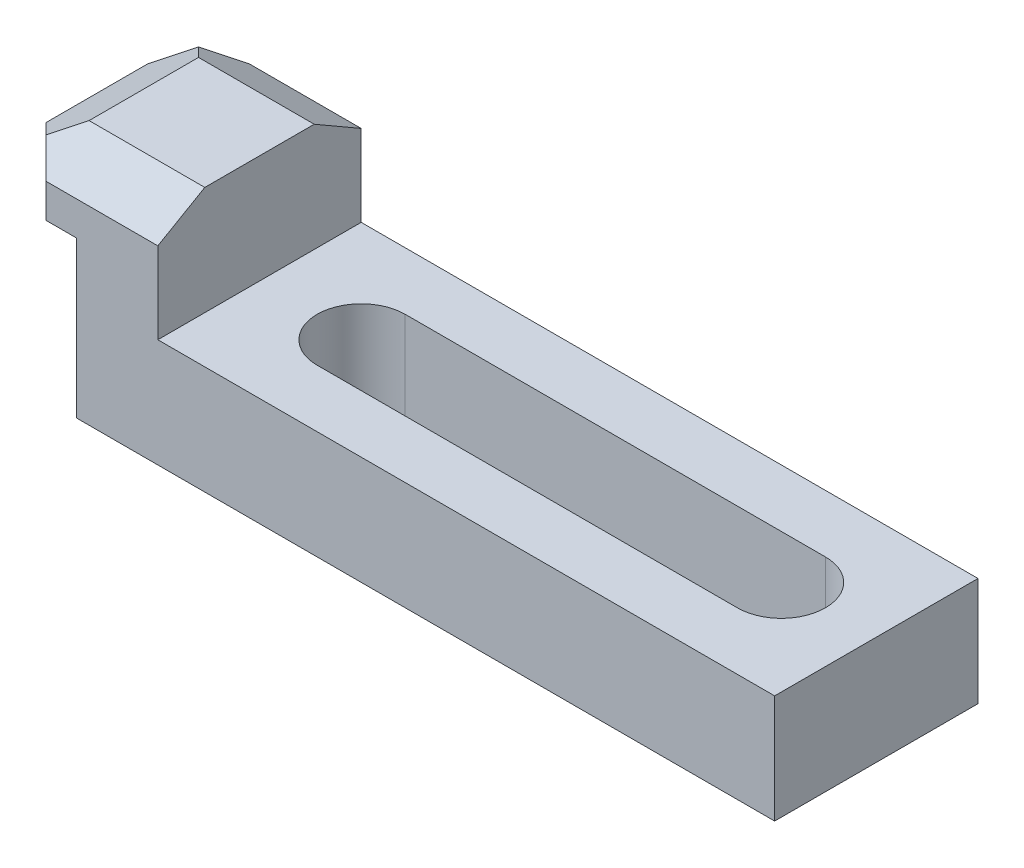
ISO-10303-21;
HEADER;
FILE_DESCRIPTION(('STEP AP214'),'2;1');
FILE_NAME('part.step','',(''),(''),'','','');
FILE_SCHEMA(('AUTOMOTIVE_DESIGN { 1 0 10303 214 1 1 1 1 }'));
ENDSEC;
DATA;
#1=APPLICATION_CONTEXT('core data for automotive mechanical design processes');
#2=APPLICATION_PROTOCOL_DEFINITION('international standard','automotive_design',2000,#1);
#3=PRODUCT_CONTEXT('',#1,'mechanical');
#4=PRODUCT('Part','Part','',(#3));
#5=PRODUCT_RELATED_PRODUCT_CATEGORY('part','',(#4));
#6=PRODUCT_DEFINITION_FORMATION('','',#4);
#7=PRODUCT_DEFINITION_CONTEXT('part definition',#1,'design');
#8=PRODUCT_DEFINITION('design','',#6,#7);
#9=PRODUCT_DEFINITION_SHAPE('','',#8);
#10=(LENGTH_UNIT() NAMED_UNIT(*) SI_UNIT(.MILLI.,.METRE.));
#11=(NAMED_UNIT(*) PLANE_ANGLE_UNIT() SI_UNIT($,.RADIAN.));
#12=(NAMED_UNIT(*) SI_UNIT($,.STERADIAN.) SOLID_ANGLE_UNIT());
#13=UNCERTAINTY_MEASURE_WITH_UNIT(LENGTH_MEASURE(1.E-05),#10,'distance_accuracy_value','');
#14=(GEOMETRIC_REPRESENTATION_CONTEXT(3) GLOBAL_UNCERTAINTY_ASSIGNED_CONTEXT((#13)) GLOBAL_UNIT_ASSIGNED_CONTEXT((#10,
#11,#12)) REPRESENTATION_CONTEXT('',''));
#15=CARTESIAN_POINT('',(0.,0.,0.));
#16=DIRECTION('',(0.,0.,1.));
#17=DIRECTION('',(1.,0.,0.));
#18=AXIS2_PLACEMENT_3D('',#15,#16,#17);
#19=CARTESIAN_POINT('',(0.,9.,15.));
#20=DIRECTION('',(1.,0.,0.));
#21=DIRECTION('',(0.,1.,0.));
#22=AXIS2_PLACEMENT_3D('',#19,#20,#21);
#23=PLANE('',#22);
#24=DIRECTION('',(0.,0.,-1.));
#25=VECTOR('',#24,1.);
#26=CARTESIAN_POINT('',(0.,4.99999999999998,15.));
#27=LINE('',#26,#25);
#28=CARTESIAN_POINT('',(0.,4.99999999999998,7.5));
#29=VERTEX_POINT('',#28);
#30=CARTESIAN_POINT('',(0.,4.99999999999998,-7.5));
#31=VERTEX_POINT('',#30);
#32=EDGE_CURVE('E171',#29,#31,#27,.T.);
#33=ORIENTED_EDGE('',*,*,#32,.T.);
#34=DIRECTION('',(0.,-1.,0.));
#35=VECTOR('',#34,1.);
#36=CARTESIAN_POINT('',(0.,9.,-7.5));
#37=LINE('',#36,#35);
#38=CARTESIAN_POINT('',(0.,0.,-7.5));
#39=VERTEX_POINT('',#38);
#40=EDGE_CURVE('E156',#31,#39,#37,.T.);
#41=ORIENTED_EDGE('',*,*,#40,.T.);
#42=DIRECTION('',(0.,0.,-1.));
#43=VECTOR('',#42,1.);
#44=CARTESIAN_POINT('',(0.,0.,15.));
#45=LINE('',#44,#43);
#46=CARTESIAN_POINT('',(0.,0.,7.5));
#47=VERTEX_POINT('',#46);
#48=EDGE_CURVE('E236',#47,#39,#45,.T.);
#49=ORIENTED_EDGE('',*,*,#48,.F.);
#50=DIRECTION('',(0.,-1.,0.));
#51=VECTOR('',#50,1.);
#52=CARTESIAN_POINT('',(0.,9.,7.5));
#53=LINE('',#52,#51);
#54=EDGE_CURVE('E177',#29,#47,#53,.T.);
#55=ORIENTED_EDGE('',*,*,#54,.F.);
#56=EDGE_LOOP('',(#33,#41,#49,#55));
#57=FACE_BOUND('',#56,.T.);
#58=ADVANCED_FACE('F39',(#57),#23,.F.);
#59=CARTESIAN_POINT('',(0.,0.,15.));
#60=DIRECTION('',(0.,1.,0.));
#61=DIRECTION('',(0.,0.,1.));
#62=AXIS2_PLACEMENT_3D('',#59,#60,#61);
#63=PLANE('',#62);
#64=ORIENTED_EDGE('',*,*,#48,.T.);
#65=DIRECTION('',(0.707106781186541,0.,-0.707106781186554));
#66=VECTOR('',#65,1.);
#67=CARTESIAN_POINT('',(-11.25,0.,3.7500000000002));
#68=LINE('',#67,#66);
#69=CARTESIAN_POINT('',(7.49999999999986,0.,-15.));
#70=VERTEX_POINT('',#69);
#71=EDGE_CURVE('E159',#39,#70,#68,.T.);
#72=ORIENTED_EDGE('',*,*,#71,.T.);
#73=DIRECTION('',(1.,0.,0.));
#74=VECTOR('',#73,1.);
#75=CARTESIAN_POINT('',(0.,0.,-15.));
#76=LINE('',#75,#74);
#77=CARTESIAN_POINT('',(12.,0.,-15.));
#78=VERTEX_POINT('',#77);
#79=EDGE_CURVE('E199',#70,#78,#76,.T.);
#80=ORIENTED_EDGE('',*,*,#79,.T.);
#81=DIRECTION('',(0.,0.,-1.));
#82=VECTOR('',#81,1.);
#83=CARTESIAN_POINT('',(12.,0.,15.));
#84=LINE('',#83,#82);
#85=CARTESIAN_POINT('',(12.,0.,15.));
#86=VERTEX_POINT('',#85);
#87=EDGE_CURVE('E353',#86,#78,#84,.T.);
#88=ORIENTED_EDGE('',*,*,#87,.F.);
#89=DIRECTION('',(1.,0.,0.));
#90=VECTOR('',#89,1.);
#91=CARTESIAN_POINT('',(0.,0.,15.));
#92=LINE('',#91,#90);
#93=CARTESIAN_POINT('',(7.49999999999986,0.,15.));
#94=VERTEX_POINT('',#93);
#95=EDGE_CURVE('E310',#94,#86,#92,.T.);
#96=ORIENTED_EDGE('',*,*,#95,.F.);
#97=DIRECTION('',(-0.707106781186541,0.,-0.707106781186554));
#98=VECTOR('',#97,1.);
#99=CARTESIAN_POINT('',(3.75,0.,11.2500000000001));
#100=LINE('',#99,#98);
#101=EDGE_CURVE('E282',#94,#47,#100,.T.);
#102=ORIENTED_EDGE('',*,*,#101,.T.);
#103=EDGE_LOOP('',(#64,#72,#80,#88,#96,#102));
#104=FACE_BOUND('',#103,.T.);
#105=ADVANCED_FACE('F358',(#104),#63,.F.);
#106=CARTESIAN_POINT('',(12.,0.,15.));
#107=DIRECTION('',(1.,0.,0.));
#108=DIRECTION('',(0.,1.,0.));
#109=AXIS2_PLACEMENT_3D('',#106,#107,#108);
#110=PLANE('',#109);
#111=DIRECTION('',(0.,-1.,0.));
#112=VECTOR('',#111,1.);
#113=CARTESIAN_POINT('',(12.,0.,-15.));
#114=LINE('',#113,#112);
#115=CARTESIAN_POINT('',(12.,-23.,-15.));
#116=VERTEX_POINT('',#115);
#117=EDGE_CURVE('E328',#78,#116,#114,.T.);
#118=ORIENTED_EDGE('',*,*,#117,.T.);
#119=DIRECTION('',(0.,0.,-1.));
#120=VECTOR('',#119,1.);
#121=CARTESIAN_POINT('',(12.,-23.,15.));
#122=LINE('',#121,#120);
#123=CARTESIAN_POINT('',(12.,-23.,15.));
#124=VERTEX_POINT('',#123);
#125=EDGE_CURVE('E350',#124,#116,#122,.T.);
#126=ORIENTED_EDGE('',*,*,#125,.F.);
#127=DIRECTION('',(0.,-1.,0.));
#128=VECTOR('',#127,1.);
#129=CARTESIAN_POINT('',(12.,0.,15.));
#130=LINE('',#129,#128);
#131=EDGE_CURVE('E312',#86,#124,#130,.T.);
#132=ORIENTED_EDGE('',*,*,#131,.F.);
#133=ORIENTED_EDGE('',*,*,#87,.T.);
#134=EDGE_LOOP('',(#118,#126,#132,#133));
#135=FACE_BOUND('',#134,.T.);
#136=ADVANCED_FACE('F381',(#135),#110,.F.);
#137=CARTESIAN_POINT('',(12.,-23.,15.));
#138=DIRECTION('',(0.,1.,0.));
#139=DIRECTION('',(0.,0.,1.));
#140=AXIS2_PLACEMENT_3D('',#137,#138,#139);
#141=PLANE('',#140);
#142=DIRECTION('',(1.,0.,0.));
#143=VECTOR('',#142,1.);
#144=CARTESIAN_POINT('',(39.,-23.,-6.5));
#145=LINE('',#144,#143);
#146=CARTESIAN_POINT('',(39.,-23.,-6.5));
#147=VERTEX_POINT('',#146);
#148=CARTESIAN_POINT('',(101.,-23.,-6.5));
#149=VERTEX_POINT('',#148);
#150=EDGE_CURVE('E287',#147,#149,#145,.T.);
#151=ORIENTED_EDGE('',*,*,#150,.F.);
#152=CARTESIAN_POINT('',(39.,-23.,0.));
#153=DIRECTION('',(0.,-1.,0.));
#154=DIRECTION('',(0.,0.,-1.));
#155=AXIS2_PLACEMENT_3D('',#152,#153,#154);
#156=CIRCLE('',#155,6.5);
#157=CARTESIAN_POINT('',(39.,-23.,6.5));
#158=VERTEX_POINT('',#157);
#159=EDGE_CURVE('E284',#158,#147,#156,.T.);
#160=ORIENTED_EDGE('',*,*,#159,.F.);
#161=DIRECTION('',(-1.,0.,0.));
#162=VECTOR('',#161,1.);
#163=CARTESIAN_POINT('',(39.,-23.,6.5));
#164=LINE('',#163,#162);
#165=CARTESIAN_POINT('',(101.,-23.,6.5));
#166=VERTEX_POINT('',#165);
#167=EDGE_CURVE('E295',#166,#158,#164,.T.);
#168=ORIENTED_EDGE('',*,*,#167,.F.);
#169=CARTESIAN_POINT('',(101.,-23.,0.));
#170=DIRECTION('',(0.,-1.,0.));
#171=DIRECTION('',(0.,0.,-1.));
#172=AXIS2_PLACEMENT_3D('',#169,#170,#171);
#173=CIRCLE('',#172,6.5);
#174=EDGE_CURVE('E291',#149,#166,#173,.T.);
#175=ORIENTED_EDGE('',*,*,#174,.F.);
#176=EDGE_LOOP('',(#151,#160,#168,#175));
#177=FACE_BOUND('',#176,.T.);
#178=DIRECTION('',(1.,0.,0.));
#179=VECTOR('',#178,1.);
#180=CARTESIAN_POINT('',(12.,-23.,-15.));
#181=LINE('',#180,#179);
#182=CARTESIAN_POINT('',(115.,-23.,-15.));
#183=VERTEX_POINT('',#182);
#184=EDGE_CURVE('E331',#116,#183,#181,.T.);
#185=ORIENTED_EDGE('',*,*,#184,.T.);
#186=DIRECTION('',(0.,0.,-1.));
#187=VECTOR('',#186,1.);
#188=CARTESIAN_POINT('',(115.,-23.,15.));
#189=LINE('',#188,#187);
#190=CARTESIAN_POINT('',(115.,-23.,15.));
#191=VERTEX_POINT('',#190);
#192=EDGE_CURVE('E347',#191,#183,#189,.T.);
#193=ORIENTED_EDGE('',*,*,#192,.F.);
#194=DIRECTION('',(1.,0.,0.));
#195=VECTOR('',#194,1.);
#196=CARTESIAN_POINT('',(12.,-23.,15.));
#197=LINE('',#196,#195);
#198=EDGE_CURVE('E314',#124,#191,#197,.T.);
#199=ORIENTED_EDGE('',*,*,#198,.F.);
#200=ORIENTED_EDGE('',*,*,#125,.T.);
#201=EDGE_LOOP('',(#185,#193,#199,#200));
#202=FACE_BOUND('',#201,.T.);
#203=ADVANCED_FACE('F378',(#177,#202),#141,.F.);
#204=CARTESIAN_POINT('',(115.,-23.,15.));
#205=DIRECTION('',(-1.,0.,0.));
#206=DIRECTION('',(0.,0.,1.));
#207=AXIS2_PLACEMENT_3D('',#204,#205,#206);
#208=PLANE('',#207);
#209=DIRECTION('',(0.,1.,0.));
#210=VECTOR('',#209,1.);
#211=CARTESIAN_POINT('',(115.,-23.,-15.));
#212=LINE('',#211,#210);
#213=CARTESIAN_POINT('',(115.,-7.,-15.));
#214=VERTEX_POINT('',#213);
#215=EDGE_CURVE('E334',#183,#214,#212,.T.);
#216=ORIENTED_EDGE('',*,*,#215,.T.);
#217=DIRECTION('',(0.,0.,-1.));
#218=VECTOR('',#217,1.);
#219=CARTESIAN_POINT('',(115.,-7.,15.));
#220=LINE('',#219,#218);
#221=CARTESIAN_POINT('',(115.,-7.,15.));
#222=VERTEX_POINT('',#221);
#223=EDGE_CURVE('E343',#222,#214,#220,.T.);
#224=ORIENTED_EDGE('',*,*,#223,.F.);
#225=DIRECTION('',(0.,1.,0.));
#226=VECTOR('',#225,1.);
#227=CARTESIAN_POINT('',(115.,-23.,15.));
#228=LINE('',#227,#226);
#229=EDGE_CURVE('E317',#191,#222,#228,.T.);
#230=ORIENTED_EDGE('',*,*,#229,.F.);
#231=ORIENTED_EDGE('',*,*,#192,.T.);
#232=EDGE_LOOP('',(#216,#224,#230,#231));
#233=FACE_BOUND('',#232,.T.);
#234=ADVANCED_FACE('F374',(#233),#208,.F.);
#235=CARTESIAN_POINT('',(115.,-7.,15.));
#236=DIRECTION('',(0.,-1.,0.));
#237=DIRECTION('',(1.,0.,0.));
#238=AXIS2_PLACEMENT_3D('',#235,#236,#237);
#239=PLANE('',#238);
#240=DIRECTION('',(-1.,0.,0.));
#241=VECTOR('',#240,1.);
#242=CARTESIAN_POINT('',(115.,-7.,6.5));
#243=LINE('',#242,#241);
#244=CARTESIAN_POINT('',(101.,-7.,6.5));
#245=VERTEX_POINT('',#244);
#246=CARTESIAN_POINT('',(39.,-7.,6.5));
#247=VERTEX_POINT('',#246);
#248=EDGE_CURVE('E203',#245,#247,#243,.T.);
#249=ORIENTED_EDGE('',*,*,#248,.T.);
#250=CARTESIAN_POINT('',(39.,-7.00000000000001,0.));
#251=DIRECTION('',(0.,-1.,0.));
#252=DIRECTION('',(1.,0.,0.));
#253=AXIS2_PLACEMENT_3D('',#250,#251,#252);
#254=CIRCLE('',#253,6.5);
#255=CARTESIAN_POINT('',(39.,-7.,-6.5));
#256=VERTEX_POINT('',#255);
#257=EDGE_CURVE('E207',#247,#256,#254,.T.);
#258=ORIENTED_EDGE('',*,*,#257,.T.);
#259=DIRECTION('',(1.,0.,0.));
#260=VECTOR('',#259,1.);
#261=CARTESIAN_POINT('',(115.,-7.,-6.5));
#262=LINE('',#261,#260);
#263=CARTESIAN_POINT('',(101.,-7.,-6.5));
#264=VERTEX_POINT('',#263);
#265=EDGE_CURVE('E179',#256,#264,#262,.T.);
#266=ORIENTED_EDGE('',*,*,#265,.T.);
#267=CARTESIAN_POINT('',(101.,-7.,0.));
#268=DIRECTION('',(0.,-1.,0.));
#269=DIRECTION('',(1.,0.,0.));
#270=AXIS2_PLACEMENT_3D('',#267,#268,#269);
#271=CIRCLE('',#270,6.5);
#272=EDGE_CURVE('E186',#264,#245,#271,.T.);
#273=ORIENTED_EDGE('',*,*,#272,.T.);
#274=EDGE_LOOP('',(#249,#258,#266,#273));
#275=FACE_BOUND('',#274,.T.);
#276=DIRECTION('',(-1.,0.,0.));
#277=VECTOR('',#276,1.);
#278=CARTESIAN_POINT('',(115.,-7.,-15.));
#279=LINE('',#278,#277);
#280=CARTESIAN_POINT('',(24.,-7.00000000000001,-15.));
#281=VERTEX_POINT('',#280);
#282=EDGE_CURVE('E337',#214,#281,#279,.T.);
#283=ORIENTED_EDGE('',*,*,#282,.T.);
#284=DIRECTION('',(0.,0.,-1.));
#285=VECTOR('',#284,1.);
#286=CARTESIAN_POINT('',(24.,-7.00000000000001,15.));
#287=LINE('',#286,#285);
#288=CARTESIAN_POINT('',(24.,-7.00000000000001,15.));
#289=VERTEX_POINT('',#288);
#290=EDGE_CURVE('E259',#289,#281,#287,.T.);
#291=ORIENTED_EDGE('',*,*,#290,.F.);
#292=DIRECTION('',(-1.,0.,0.));
#293=VECTOR('',#292,1.);
#294=CARTESIAN_POINT('',(115.,-7.,15.));
#295=LINE('',#294,#293);
#296=EDGE_CURVE('E320',#222,#289,#295,.T.);
#297=ORIENTED_EDGE('',*,*,#296,.F.);
#298=ORIENTED_EDGE('',*,*,#223,.T.);
#299=EDGE_LOOP('',(#283,#291,#297,#298));
#300=FACE_BOUND('',#299,.T.);
#301=ADVANCED_FACE('F370',(#275,#300),#239,.F.);
#302=CARTESIAN_POINT('',(24.,-7.00000000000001,15.));
#303=DIRECTION('',(-1.,0.,0.));
#304=DIRECTION('',(0.,-1.,0.));
#305=AXIS2_PLACEMENT_3D('',#302,#303,#304);
#306=PLANE('',#305);
#307=DIRECTION('',(0.,1.,0.));
#308=VECTOR('',#307,1.);
#309=CARTESIAN_POINT('',(24.,-7.00000000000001,-15.));
#310=LINE('',#309,#308);
#311=CARTESIAN_POINT('',(24.,4.99999999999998,-15.));
#312=VERTEX_POINT('',#311);
#313=EDGE_CURVE('E253',#281,#312,#310,.T.);
#314=ORIENTED_EDGE('',*,*,#313,.T.);
#315=DIRECTION('',(0.,-0.500000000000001,-0.866025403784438));
#316=VECTOR('',#315,1.);
#317=CARTESIAN_POINT('',(24.,9.,-8.07179676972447));
#318=LINE('',#317,#316);
#319=CARTESIAN_POINT('',(24.,9.,-8.07179676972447));
#320=VERTEX_POINT('',#319);
#321=EDGE_CURVE('E190',#312,#320,#318,.F.);
#322=ORIENTED_EDGE('',*,*,#321,.T.);
#323=DIRECTION('',(0.,0.,-1.));
#324=VECTOR('',#323,1.);
#325=CARTESIAN_POINT('',(24.,9.,15.));
#326=LINE('',#325,#324);
#327=CARTESIAN_POINT('',(24.,9.,8.07179676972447));
#328=VERTEX_POINT('',#327);
#329=EDGE_CURVE('E250',#328,#320,#326,.T.);
#330=ORIENTED_EDGE('',*,*,#329,.F.);
#331=DIRECTION('',(0.,-0.500000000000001,0.866025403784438));
#332=VECTOR('',#331,1.);
#333=CARTESIAN_POINT('',(24.,4.99999999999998,15.));
#334=LINE('',#333,#332);
#335=CARTESIAN_POINT('',(24.,4.99999999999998,15.));
#336=VERTEX_POINT('',#335);
#337=EDGE_CURVE('E221',#328,#336,#334,.T.);
#338=ORIENTED_EDGE('',*,*,#337,.T.);
#339=DIRECTION('',(0.,1.,0.));
#340=VECTOR('',#339,1.);
#341=CARTESIAN_POINT('',(24.,-7.00000000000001,15.));
#342=LINE('',#341,#340);
#343=EDGE_CURVE('E260',#289,#336,#342,.T.);
#344=ORIENTED_EDGE('',*,*,#343,.F.);
#345=ORIENTED_EDGE('',*,*,#290,.T.);
#346=EDGE_LOOP('',(#314,#322,#330,#338,#344,#345));
#347=FACE_BOUND('',#346,.T.);
#348=ADVANCED_FACE('F249',(#347),#306,.F.);
#349=CARTESIAN_POINT('',(24.,9.,15.));
#350=DIRECTION('',(0.,-1.,0.));
#351=DIRECTION('',(1.,0.,0.));
#352=AXIS2_PLACEMENT_3D('',#349,#350,#351);
#353=PLANE('',#352);
#354=ORIENTED_EDGE('',*,*,#329,.T.);
#355=DIRECTION('',(-1.,0.,0.));
#356=VECTOR('',#355,1.);
#357=CARTESIAN_POINT('',(24.,9.,-8.07179676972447));
#358=LINE('',#357,#356);
#359=CARTESIAN_POINT('',(6.92820323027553,9.,-8.07179676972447));
#360=VERTEX_POINT('',#359);
#361=EDGE_CURVE('E226',#320,#360,#358,.T.);
#362=ORIENTED_EDGE('',*,*,#361,.T.);
#363=DIRECTION('',(0.,0.,1.));
#364=VECTOR('',#363,1.);
#365=CARTESIAN_POINT('',(6.92820323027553,9.,15.));
#366=LINE('',#365,#364);
#367=CARTESIAN_POINT('',(6.92820323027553,9.,8.07179676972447));
#368=VERTEX_POINT('',#367);
#369=EDGE_CURVE('E227',#360,#368,#366,.T.);
#370=ORIENTED_EDGE('',*,*,#369,.T.);
#371=DIRECTION('',(1.,0.,0.));
#372=VECTOR('',#371,1.);
#373=CARTESIAN_POINT('',(24.,9.,8.07179676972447));
#374=LINE('',#373,#372);
#375=EDGE_CURVE('E220',#368,#328,#374,.T.);
#376=ORIENTED_EDGE('',*,*,#375,.T.);
#377=EDGE_LOOP('',(#354,#362,#370,#376));
#378=FACE_BOUND('',#377,.T.);
#379=ADVANCED_FACE('F257',(#378),#353,.F.);
#380=CARTESIAN_POINT('',(0.,0.,15.));
#381=DIRECTION('',(0.,0.,1.));
#382=DIRECTION('',(1.,0.,0.));
#383=AXIS2_PLACEMENT_3D('',#380,#381,#382);
#384=PLANE('',#383);
#385=DIRECTION('',(0.,-1.,0.));
#386=VECTOR('',#385,1.);
#387=CARTESIAN_POINT('',(7.49999999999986,9.,15.));
#388=LINE('',#387,#386);
#389=CARTESIAN_POINT('',(7.49999999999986,4.99999999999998,15.));
#390=VERTEX_POINT('',#389);
#391=EDGE_CURVE('E274',#390,#94,#388,.T.);
#392=ORIENTED_EDGE('',*,*,#391,.T.);
#393=ORIENTED_EDGE('',*,*,#95,.T.);
#394=ORIENTED_EDGE('',*,*,#131,.T.);
#395=ORIENTED_EDGE('',*,*,#198,.T.);
#396=ORIENTED_EDGE('',*,*,#229,.T.);
#397=ORIENTED_EDGE('',*,*,#296,.T.);
#398=ORIENTED_EDGE('',*,*,#343,.T.);
#399=DIRECTION('',(-1.,0.,0.));
#400=VECTOR('',#399,1.);
#401=CARTESIAN_POINT('',(0.,4.99999999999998,15.));
#402=LINE('',#401,#400);
#403=EDGE_CURVE('E180',#336,#390,#402,.T.);
#404=ORIENTED_EDGE('',*,*,#403,.T.);
#405=EDGE_LOOP('',(#392,#393,#394,#395,#396,#397,#398,#404));
#406=FACE_BOUND('',#405,.T.);
#407=ADVANCED_FACE('F362',(#406),#384,.T.);
#408=CARTESIAN_POINT('',(0.,0.,-15.));
#409=DIRECTION('',(0.,0.,1.));
#410=DIRECTION('',(1.,0.,0.));
#411=AXIS2_PLACEMENT_3D('',#408,#409,#410);
#412=PLANE('',#411);
#413=ORIENTED_EDGE('',*,*,#79,.F.);
#414=DIRECTION('',(0.,-1.,0.));
#415=VECTOR('',#414,1.);
#416=CARTESIAN_POINT('',(7.49999999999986,9.,-15.));
#417=LINE('',#416,#415);
#418=CARTESIAN_POINT('',(7.49999999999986,4.99999999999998,-15.));
#419=VERTEX_POINT('',#418);
#420=EDGE_CURVE('E165',#419,#70,#417,.T.);
#421=ORIENTED_EDGE('',*,*,#420,.F.);
#422=DIRECTION('',(1.,0.,0.));
#423=VECTOR('',#422,1.);
#424=CARTESIAN_POINT('',(0.,4.99999999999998,-15.));
#425=LINE('',#424,#423);
#426=EDGE_CURVE('E233',#419,#312,#425,.T.);
#427=ORIENTED_EDGE('',*,*,#426,.T.);
#428=ORIENTED_EDGE('',*,*,#313,.F.);
#429=ORIENTED_EDGE('',*,*,#282,.F.);
#430=ORIENTED_EDGE('',*,*,#215,.F.);
#431=ORIENTED_EDGE('',*,*,#184,.F.);
#432=ORIENTED_EDGE('',*,*,#117,.F.);
#433=EDGE_LOOP('',(#413,#421,#427,#428,#429,#430,#431,#432));
#434=FACE_BOUND('',#433,.T.);
#435=ADVANCED_FACE('F266',(#434),#412,.F.);
#436=CARTESIAN_POINT('',(0.,4.99999999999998,15.));
#437=DIRECTION('',(0.,0.866025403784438,0.500000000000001));
#438=DIRECTION('',(0.,-0.500000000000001,0.866025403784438));
#439=AXIS2_PLACEMENT_3D('',#436,#437,#438);
#440=PLANE('',#439);
#441=DIRECTION('',(-0.65465367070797,0.377964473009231,-0.654653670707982));
#442=VECTOR('',#441,1.);
#443=CARTESIAN_POINT('',(4.28571428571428,6.85576872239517,11.7857142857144));
#444=LINE('',#443,#442);
#445=CARTESIAN_POINT('',(3.74999999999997,7.16506350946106,11.25));
#446=VERTEX_POINT('',#445);
#447=EDGE_CURVE('E62',#390,#446,#444,.T.);
#448=ORIENTED_EDGE('',*,*,#447,.F.);
#449=ORIENTED_EDGE('',*,*,#403,.F.);
#450=ORIENTED_EDGE('',*,*,#337,.F.);
#451=ORIENTED_EDGE('',*,*,#375,.F.);
#452=DIRECTION('',(-0.654653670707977,-0.377964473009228,0.654653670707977));
#453=VECTOR('',#452,1.);
#454=CARTESIAN_POINT('',(0.,4.99999999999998,15.));
#455=LINE('',#454,#453);
#456=EDGE_CURVE('E196',#446,#368,#455,.F.);
#457=ORIENTED_EDGE('',*,*,#456,.F.);
#458=EDGE_LOOP('',(#448,#449,#450,#451,#457));
#459=FACE_BOUND('',#458,.T.);
#460=ADVANCED_FACE('F41',(#459),#440,.T.);
#461=CARTESIAN_POINT('',(0.,4.99999999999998,15.));
#462=DIRECTION('',(0.500000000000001,-0.866025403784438,0.));
#463=DIRECTION('',(0.866025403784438,0.500000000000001,0.));
#464=AXIS2_PLACEMENT_3D('',#461,#462,#463);
#465=PLANE('',#464);
#466=DIRECTION('',(-0.654653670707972,-0.377964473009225,0.654653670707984));
#467=VECTOR('',#466,1.);
#468=CARTESIAN_POINT('',(-9.64285714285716,-0.567306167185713,2.14285714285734));
#469=LINE('',#468,#467);
#470=CARTESIAN_POINT('',(3.74999999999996,7.16506350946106,-11.25));
#471=VERTEX_POINT('',#470);
#472=EDGE_CURVE('E54',#31,#471,#469,.F.);
#473=ORIENTED_EDGE('',*,*,#472,.F.);
#474=ORIENTED_EDGE('',*,*,#32,.F.);
#475=DIRECTION('',(0.654653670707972,0.377964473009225,0.654653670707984));
#476=VECTOR('',#475,1.);
#477=CARTESIAN_POINT('',(3.21428571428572,6.85576872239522,10.7142857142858));
#478=LINE('',#477,#476);
#479=EDGE_CURVE('E48',#446,#29,#478,.F.);
#480=ORIENTED_EDGE('',*,*,#479,.F.);
#481=ORIENTED_EDGE('',*,*,#456,.T.);
#482=ORIENTED_EDGE('',*,*,#369,.F.);
#483=DIRECTION('',(-0.654653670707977,-0.377964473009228,-0.654653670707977));
#484=VECTOR('',#483,1.);
#485=CARTESIAN_POINT('',(12.8571428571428,12.4230748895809,-2.14285714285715));
#486=LINE('',#485,#484);
#487=EDGE_CURVE('E173',#471,#360,#486,.F.);
#488=ORIENTED_EDGE('',*,*,#487,.F.);
#489=EDGE_LOOP('',(#473,#474,#480,#481,#482,#488));
#490=FACE_BOUND('',#489,.T.);
#491=ADVANCED_FACE('F170',(#490),#465,.F.);
#492=CARTESIAN_POINT('',(24.,9.,-8.07179676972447));
#493=DIRECTION('',(0.,-0.866025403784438,0.500000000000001));
#494=DIRECTION('',(0.,-0.500000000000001,-0.866025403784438));
#495=AXIS2_PLACEMENT_3D('',#492,#493,#494);
#496=PLANE('',#495);
#497=DIRECTION('',(-0.65465367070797,0.377964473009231,0.654653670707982));
#498=VECTOR('',#497,1.);
#499=CARTESIAN_POINT('',(10.6124552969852,3.20302309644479,-18.1124552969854));
#500=LINE('',#499,#498);
#501=EDGE_CURVE('E11',#471,#419,#500,.F.);
#502=ORIENTED_EDGE('',*,*,#501,.F.);
#503=ORIENTED_EDGE('',*,*,#487,.T.);
#504=ORIENTED_EDGE('',*,*,#361,.F.);
#505=ORIENTED_EDGE('',*,*,#321,.F.);
#506=ORIENTED_EDGE('',*,*,#426,.F.);
#507=EDGE_LOOP('',(#502,#503,#504,#505,#506));
#508=FACE_BOUND('',#507,.T.);
#509=ADVANCED_FACE('F262',(#508),#496,.F.);
#510=CARTESIAN_POINT('',(39.,9.,0.));
#511=DIRECTION('',(0.,-1.,0.));
#512=DIRECTION('',(0.,0.,-1.));
#513=AXIS2_PLACEMENT_3D('',#510,#511,#512);
#514=CYLINDRICAL_SURFACE('',#513,6.5);
#515=DIRECTION('',(0.,-1.,0.));
#516=VECTOR('',#515,1.);
#517=CARTESIAN_POINT('',(39.,9.,6.5));
#518=LINE('',#517,#516);
#519=EDGE_CURVE('E197',#247,#158,#518,.T.);
#520=ORIENTED_EDGE('',*,*,#519,.T.);
#521=ORIENTED_EDGE('',*,*,#159,.T.);
#522=DIRECTION('',(0.,-1.,0.));
#523=VECTOR('',#522,1.);
#524=CARTESIAN_POINT('',(39.,9.,-6.5));
#525=LINE('',#524,#523);
#526=EDGE_CURVE('E299',#256,#147,#525,.T.);
#527=ORIENTED_EDGE('',*,*,#526,.F.);
#528=ORIENTED_EDGE('',*,*,#257,.F.);
#529=EDGE_LOOP('',(#520,#521,#527,#528));
#530=FACE_BOUND('',#529,.T.);
#531=ADVANCED_FACE('F398',(#530),#514,.F.);
#532=CARTESIAN_POINT('',(39.,9.,6.5));
#533=DIRECTION('',(0.,0.,1.));
#534=DIRECTION('',(1.,0.,0.));
#535=AXIS2_PLACEMENT_3D('',#532,#533,#534);
#536=PLANE('',#535);
#537=DIRECTION('',(0.,-1.,0.));
#538=VECTOR('',#537,1.);
#539=CARTESIAN_POINT('',(101.,9.,6.5));
#540=LINE('',#539,#538);
#541=EDGE_CURVE('E301',#245,#166,#540,.T.);
#542=ORIENTED_EDGE('',*,*,#541,.T.);
#543=ORIENTED_EDGE('',*,*,#167,.T.);
#544=ORIENTED_EDGE('',*,*,#519,.F.);
#545=ORIENTED_EDGE('',*,*,#248,.F.);
#546=EDGE_LOOP('',(#542,#543,#544,#545));
#547=FACE_BOUND('',#546,.T.);
#548=ADVANCED_FACE('F458',(#547),#536,.F.);
#549=CARTESIAN_POINT('',(101.,9.,0.));
#550=DIRECTION('',(0.,-1.,0.));
#551=DIRECTION('',(0.,0.,-1.));
#552=AXIS2_PLACEMENT_3D('',#549,#550,#551);
#553=CYLINDRICAL_SURFACE('',#552,6.5);
#554=DIRECTION('',(0.,-1.,0.));
#555=VECTOR('',#554,1.);
#556=CARTESIAN_POINT('',(101.,9.,-6.5));
#557=LINE('',#556,#555);
#558=EDGE_CURVE('E304',#264,#149,#557,.T.);
#559=ORIENTED_EDGE('',*,*,#558,.T.);
#560=ORIENTED_EDGE('',*,*,#174,.T.);
#561=ORIENTED_EDGE('',*,*,#541,.F.);
#562=ORIENTED_EDGE('',*,*,#272,.F.);
#563=EDGE_LOOP('',(#559,#560,#561,#562));
#564=FACE_BOUND('',#563,.T.);
#565=ADVANCED_FACE('F466',(#564),#553,.F.);
#566=CARTESIAN_POINT('',(39.,9.,-6.5));
#567=DIRECTION('',(0.,0.,-1.));
#568=DIRECTION('',(-1.,0.,0.));
#569=AXIS2_PLACEMENT_3D('',#566,#567,#568);
#570=PLANE('',#569);
#571=ORIENTED_EDGE('',*,*,#526,.T.);
#572=ORIENTED_EDGE('',*,*,#150,.T.);
#573=ORIENTED_EDGE('',*,*,#558,.F.);
#574=ORIENTED_EDGE('',*,*,#265,.F.);
#575=EDGE_LOOP('',(#571,#572,#573,#574));
#576=FACE_BOUND('',#575,.T.);
#577=ADVANCED_FACE('F475',(#576),#570,.F.);
#578=CARTESIAN_POINT('',(7.49999999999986,9.,15.));
#579=DIRECTION('',(0.707106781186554,0.,-0.707106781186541));
#580=DIRECTION('',(-0.707106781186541,0.,-0.707106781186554));
#581=AXIS2_PLACEMENT_3D('',#578,#579,#580);
#582=PLANE('',#581);
#583=ORIENTED_EDGE('',*,*,#391,.F.);
#584=ORIENTED_EDGE('',*,*,#447,.T.);
#585=ORIENTED_EDGE('',*,*,#479,.T.);
#586=ORIENTED_EDGE('',*,*,#54,.T.);
#587=ORIENTED_EDGE('',*,*,#101,.F.);
#588=EDGE_LOOP('',(#583,#584,#585,#586,#587));
#589=FACE_BOUND('',#588,.T.);
#590=ADVANCED_FACE('F212',(#589),#582,.F.);
#591=CARTESIAN_POINT('',(7.49999999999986,9.,-15.));
#592=DIRECTION('',(0.707106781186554,0.,0.707106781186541));
#593=DIRECTION('',(0.707106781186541,0.,-0.707106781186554));
#594=AXIS2_PLACEMENT_3D('',#591,#592,#593);
#595=PLANE('',#594);
#596=ORIENTED_EDGE('',*,*,#40,.F.);
#597=ORIENTED_EDGE('',*,*,#472,.T.);
#598=ORIENTED_EDGE('',*,*,#501,.T.);
#599=ORIENTED_EDGE('',*,*,#420,.T.);
#600=ORIENTED_EDGE('',*,*,#71,.F.);
#601=EDGE_LOOP('',(#596,#597,#598,#599,#600));
#602=FACE_BOUND('',#601,.T.);
#603=ADVANCED_FACE('F157',(#602),#595,.F.);
#604=CLOSED_SHELL('',(#58,#105,#136,#203,#234,#301,#348,#379,#407,#435,#460,#491,#509,#531,#548,
#565,#577,#590,#603));
#605=MANIFOLD_SOLID_BREP('B2',#604);
#606=ADVANCED_BREP_SHAPE_REPRESENTATION('',(#18,#605),#14);
#607=SHAPE_DEFINITION_REPRESENTATION(#9,#606);
ENDSEC;
END-ISO-10303-21;
